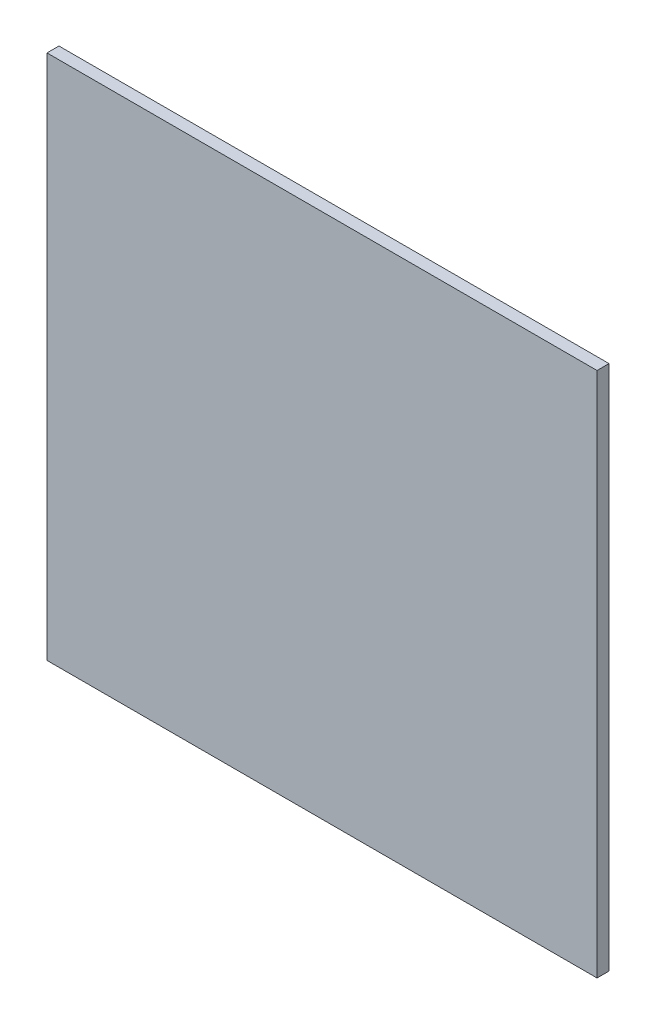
ISO-10303-21;
HEADER;
FILE_DESCRIPTION(('STEP AP214'),'2;1');
FILE_NAME('part.step','',(''),(''),'','','');
FILE_SCHEMA(('AUTOMOTIVE_DESIGN { 1 0 10303 214 1 1 1 1 }'));
ENDSEC;
DATA;
#1=APPLICATION_CONTEXT('core data for automotive mechanical design processes');
#2=APPLICATION_PROTOCOL_DEFINITION('international standard','automotive_design',2000,#1);
#3=PRODUCT_CONTEXT('',#1,'mechanical');
#4=PRODUCT('Part','Part','',(#3));
#5=PRODUCT_RELATED_PRODUCT_CATEGORY('part','',(#4));
#6=PRODUCT_DEFINITION_FORMATION('','',#4);
#7=PRODUCT_DEFINITION_CONTEXT('part definition',#1,'design');
#8=PRODUCT_DEFINITION('design','',#6,#7);
#9=PRODUCT_DEFINITION_SHAPE('','',#8);
#10=(LENGTH_UNIT() NAMED_UNIT(*) SI_UNIT(.MILLI.,.METRE.));
#11=(NAMED_UNIT(*) PLANE_ANGLE_UNIT() SI_UNIT($,.RADIAN.));
#12=(NAMED_UNIT(*) SI_UNIT($,.STERADIAN.) SOLID_ANGLE_UNIT());
#13=UNCERTAINTY_MEASURE_WITH_UNIT(LENGTH_MEASURE(1.E-05),#10,'distance_accuracy_value','');
#14=(GEOMETRIC_REPRESENTATION_CONTEXT(3) GLOBAL_UNCERTAINTY_ASSIGNED_CONTEXT((#13)) GLOBAL_UNIT_ASSIGNED_CONTEXT((#10,
#11,#12)) REPRESENTATION_CONTEXT('',''));
#15=CARTESIAN_POINT('',(0.,0.,0.));
#16=DIRECTION('',(0.,0.,1.));
#17=DIRECTION('',(1.,0.,0.));
#18=AXIS2_PLACEMENT_3D('',#15,#16,#17);
#19=CARTESIAN_POINT('',(0.,0.,2.5));
#20=DIRECTION('',(1.,0.,0.));
#21=DIRECTION('',(0.,0.,-1.));
#22=AXIS2_PLACEMENT_3D('',#19,#20,#21);
#23=PLANE('',#22);
#24=DIRECTION('',(0.,-1.,0.));
#25=VECTOR('',#24,1.);
#26=CARTESIAN_POINT('',(0.,0.,0.));
#27=LINE('',#26,#25);
#28=CARTESIAN_POINT('',(0.,110.,0.));
#29=VERTEX_POINT('',#28);
#30=CARTESIAN_POINT('',(0.,0.,0.));
#31=VERTEX_POINT('',#30);
#32=EDGE_CURVE('E78',#29,#31,#27,.T.);
#33=ORIENTED_EDGE('',*,*,#32,.T.);
#34=DIRECTION('',(0.,0.,-1.));
#35=VECTOR('',#34,1.);
#36=CARTESIAN_POINT('',(0.,0.,2.5));
#37=LINE('',#36,#35);
#38=CARTESIAN_POINT('',(0.,0.,2.5));
#39=VERTEX_POINT('',#38);
#40=EDGE_CURVE('E11',#39,#31,#37,.T.);
#41=ORIENTED_EDGE('',*,*,#40,.F.);
#42=DIRECTION('',(0.,-1.,0.));
#43=VECTOR('',#42,1.);
#44=CARTESIAN_POINT('',(0.,0.,2.5));
#45=LINE('',#44,#43);
#46=CARTESIAN_POINT('',(0.,110.,2.5));
#47=VERTEX_POINT('',#46);
#48=EDGE_CURVE('E96',#47,#39,#45,.T.);
#49=ORIENTED_EDGE('',*,*,#48,.F.);
#50=DIRECTION('',(0.,0.,-1.));
#51=VECTOR('',#50,1.);
#52=CARTESIAN_POINT('',(0.,110.,2.5));
#53=LINE('',#52,#51);
#54=EDGE_CURVE('E90',#47,#29,#53,.T.);
#55=ORIENTED_EDGE('',*,*,#54,.T.);
#56=EDGE_LOOP('',(#33,#41,#49,#55));
#57=FACE_BOUND('',#56,.T.);
#58=ADVANCED_FACE('F34',(#57),#23,.F.);
#59=CARTESIAN_POINT('',(0.,0.,2.5));
#60=DIRECTION('',(0.,1.,0.));
#61=DIRECTION('',(0.,0.,1.));
#62=AXIS2_PLACEMENT_3D('',#59,#60,#61);
#63=PLANE('',#62);
#64=DIRECTION('',(1.,0.,0.));
#65=VECTOR('',#64,1.);
#66=CARTESIAN_POINT('',(0.,0.,0.));
#67=LINE('',#66,#65);
#68=CARTESIAN_POINT('',(115.,0.,0.));
#69=VERTEX_POINT('',#68);
#70=EDGE_CURVE('E74',#31,#69,#67,.T.);
#71=ORIENTED_EDGE('',*,*,#70,.T.);
#72=DIRECTION('',(0.,0.,-1.));
#73=VECTOR('',#72,1.);
#74=CARTESIAN_POINT('',(115.,0.,2.5));
#75=LINE('',#74,#73);
#76=CARTESIAN_POINT('',(115.,0.,2.5));
#77=VERTEX_POINT('',#76);
#78=EDGE_CURVE('E41',#77,#69,#75,.T.);
#79=ORIENTED_EDGE('',*,*,#78,.F.);
#80=DIRECTION('',(1.,0.,0.));
#81=VECTOR('',#80,1.);
#82=CARTESIAN_POINT('',(0.,0.,2.5));
#83=LINE('',#82,#81);
#84=EDGE_CURVE('E86',#39,#77,#83,.T.);
#85=ORIENTED_EDGE('',*,*,#84,.F.);
#86=ORIENTED_EDGE('',*,*,#40,.T.);
#87=EDGE_LOOP('',(#71,#79,#85,#86));
#88=FACE_BOUND('',#87,.T.);
#89=ADVANCED_FACE('F85',(#88),#63,.F.);
#90=CARTESIAN_POINT('',(115.,0.,2.5));
#91=DIRECTION('',(-1.,0.,0.));
#92=DIRECTION('',(0.,0.,1.));
#93=AXIS2_PLACEMENT_3D('',#90,#91,#92);
#94=PLANE('',#93);
#95=DIRECTION('',(0.,1.,0.));
#96=VECTOR('',#95,1.);
#97=CARTESIAN_POINT('',(115.,0.,0.));
#98=LINE('',#97,#96);
#99=CARTESIAN_POINT('',(115.,110.,0.));
#100=VERTEX_POINT('',#99);
#101=EDGE_CURVE('E79',#69,#100,#98,.T.);
#102=ORIENTED_EDGE('',*,*,#101,.T.);
#103=DIRECTION('',(0.,0.,-1.));
#104=VECTOR('',#103,1.);
#105=CARTESIAN_POINT('',(115.,110.,2.5));
#106=LINE('',#105,#104);
#107=CARTESIAN_POINT('',(115.,110.,2.5));
#108=VERTEX_POINT('',#107);
#109=EDGE_CURVE('E102',#108,#100,#106,.T.);
#110=ORIENTED_EDGE('',*,*,#109,.F.);
#111=DIRECTION('',(0.,1.,0.));
#112=VECTOR('',#111,1.);
#113=CARTESIAN_POINT('',(115.,0.,2.5));
#114=LINE('',#113,#112);
#115=EDGE_CURVE('E53',#77,#108,#114,.T.);
#116=ORIENTED_EDGE('',*,*,#115,.F.);
#117=ORIENTED_EDGE('',*,*,#78,.T.);
#118=EDGE_LOOP('',(#102,#110,#116,#117));
#119=FACE_BOUND('',#118,.T.);
#120=ADVANCED_FACE('F105',(#119),#94,.F.);
#121=CARTESIAN_POINT('',(0.,110.,2.5));
#122=DIRECTION('',(0.,-1.,0.));
#123=DIRECTION('',(0.,0.,-1.));
#124=AXIS2_PLACEMENT_3D('',#121,#122,#123);
#125=PLANE('',#124);
#126=DIRECTION('',(-1.,0.,0.));
#127=VECTOR('',#126,1.);
#128=CARTESIAN_POINT('',(0.,110.,0.));
#129=LINE('',#128,#127);
#130=EDGE_CURVE('E94',#100,#29,#129,.T.);
#131=ORIENTED_EDGE('',*,*,#130,.T.);
#132=ORIENTED_EDGE('',*,*,#54,.F.);
#133=DIRECTION('',(-1.,0.,0.));
#134=VECTOR('',#133,1.);
#135=CARTESIAN_POINT('',(0.,110.,2.5));
#136=LINE('',#135,#134);
#137=EDGE_CURVE('E48',#108,#47,#136,.T.);
#138=ORIENTED_EDGE('',*,*,#137,.F.);
#139=ORIENTED_EDGE('',*,*,#109,.T.);
#140=EDGE_LOOP('',(#131,#132,#138,#139));
#141=FACE_BOUND('',#140,.T.);
#142=ADVANCED_FACE('F107',(#141),#125,.F.);
#143=CARTESIAN_POINT('',(0.,110.,2.5));
#144=DIRECTION('',(0.,0.,-1.));
#145=DIRECTION('',(-1.,0.,0.));
#146=AXIS2_PLACEMENT_3D('',#143,#144,#145);
#147=PLANE('',#146);
#148=ORIENTED_EDGE('',*,*,#48,.T.);
#149=ORIENTED_EDGE('',*,*,#84,.T.);
#150=ORIENTED_EDGE('',*,*,#115,.T.);
#151=ORIENTED_EDGE('',*,*,#137,.T.);
#152=EDGE_LOOP('',(#148,#149,#150,#151));
#153=FACE_BOUND('',#152,.T.);
#154=ADVANCED_FACE('F108',(#153),#147,.F.);
#155=CARTESIAN_POINT('',(0.,110.,0.));
#156=DIRECTION('',(0.,0.,-1.));
#157=DIRECTION('',(-1.,0.,0.));
#158=AXIS2_PLACEMENT_3D('',#155,#156,#157);
#159=PLANE('',#158);
#160=ORIENTED_EDGE('',*,*,#32,.F.);
#161=ORIENTED_EDGE('',*,*,#130,.F.);
#162=ORIENTED_EDGE('',*,*,#101,.F.);
#163=ORIENTED_EDGE('',*,*,#70,.F.);
#164=EDGE_LOOP('',(#160,#161,#162,#163));
#165=FACE_BOUND('',#164,.T.);
#166=ADVANCED_FACE('F75',(#165),#159,.T.);
#167=CLOSED_SHELL('',(#58,#89,#120,#142,#154,#166));
#168=MANIFOLD_SOLID_BREP('B2',#167);
#169=ADVANCED_BREP_SHAPE_REPRESENTATION('',(#18,#168),#14);
#170=SHAPE_DEFINITION_REPRESENTATION(#9,#169);
ENDSEC;
END-ISO-10303-21;
